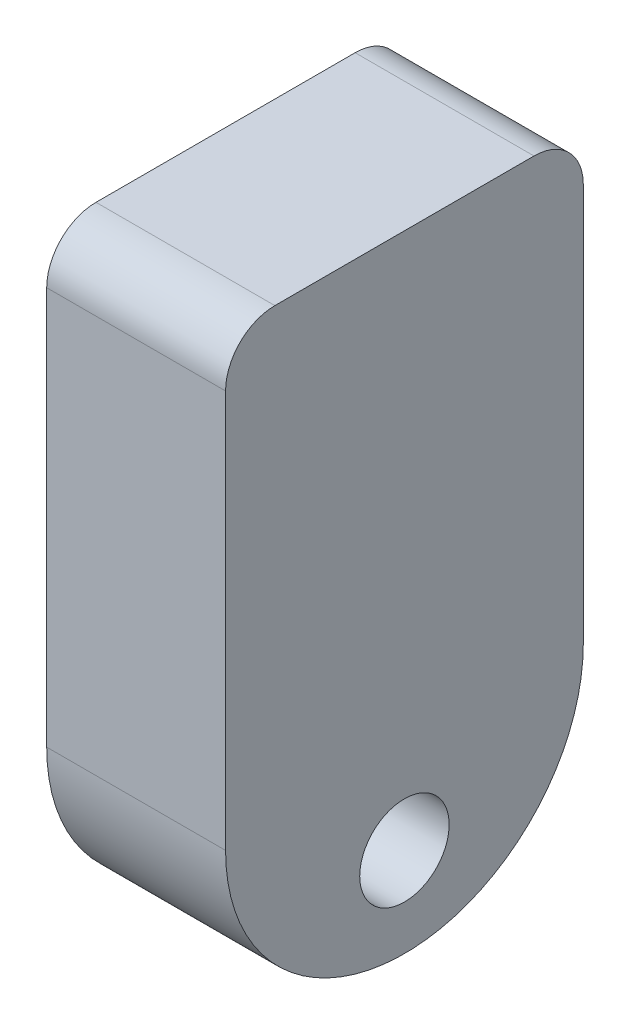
ISO-10303-21;
HEADER;
FILE_DESCRIPTION(('STEP AP214'),'2;1');
FILE_NAME('part.step','',(''),(''),'','','');
FILE_SCHEMA(('AUTOMOTIVE_DESIGN { 1 0 10303 214 1 1 1 1 }'));
ENDSEC;
DATA;
#1=APPLICATION_CONTEXT('core data for automotive mechanical design processes');
#2=APPLICATION_PROTOCOL_DEFINITION('international standard','automotive_design',2000,#1);
#3=PRODUCT_CONTEXT('',#1,'mechanical');
#4=PRODUCT('Part','Part','',(#3));
#5=PRODUCT_RELATED_PRODUCT_CATEGORY('part','',(#4));
#6=PRODUCT_DEFINITION_FORMATION('','',#4);
#7=PRODUCT_DEFINITION_CONTEXT('part definition',#1,'design');
#8=PRODUCT_DEFINITION('design','',#6,#7);
#9=PRODUCT_DEFINITION_SHAPE('','',#8);
#10=(LENGTH_UNIT() NAMED_UNIT(*) SI_UNIT(.MILLI.,.METRE.));
#11=(NAMED_UNIT(*) PLANE_ANGLE_UNIT() SI_UNIT($,.RADIAN.));
#12=(NAMED_UNIT(*) SI_UNIT($,.STERADIAN.) SOLID_ANGLE_UNIT());
#13=UNCERTAINTY_MEASURE_WITH_UNIT(LENGTH_MEASURE(1.E-05),#10,'distance_accuracy_value','');
#14=(GEOMETRIC_REPRESENTATION_CONTEXT(3) GLOBAL_UNCERTAINTY_ASSIGNED_CONTEXT((#13)) GLOBAL_UNIT_ASSIGNED_CONTEXT((#10,
#11,#12)) REPRESENTATION_CONTEXT('',''));
#15=CARTESIAN_POINT('',(0.,0.,0.));
#16=DIRECTION('',(0.,0.,1.));
#17=DIRECTION('',(1.,0.,0.));
#18=AXIS2_PLACEMENT_3D('',#15,#16,#17);
#19=CARTESIAN_POINT('',(25.4,0.,0.));
#20=DIRECTION('',(-1.,0.,0.));
#21=DIRECTION('',(0.,0.,1.));
#22=AXIS2_PLACEMENT_3D('',#19,#20,#21);
#23=PLANE('',#22);
#24=CARTESIAN_POINT('',(25.4,12.7,-25.4));
#25=DIRECTION('',(-1.,0.,0.));
#26=DIRECTION('',(0.,0.,1.));
#27=AXIS2_PLACEMENT_3D('',#24,#25,#26);
#28=CIRCLE('',#27,6.35);
#29=CARTESIAN_POINT('',(25.4,12.7,-19.05));
#30=VERTEX_POINT('',#29);
#31=EDGE_CURVE('E117',#30,#30,#28,.F.);
#32=ORIENTED_EDGE('',*,*,#31,.F.);
#33=EDGE_LOOP('',(#32));
#34=FACE_BOUND('',#33,.T.);
#35=DIRECTION('',(0.,1.,0.));
#36=VECTOR('',#35,1.);
#37=CARTESIAN_POINT('',(25.4,0.,-50.8));
#38=LINE('',#37,#36);
#39=CARTESIAN_POINT('',(25.4,25.4,-50.8));
#40=VERTEX_POINT('',#39);
#41=CARTESIAN_POINT('',(25.4,81.9,-50.8));
#42=VERTEX_POINT('',#41);
#43=EDGE_CURVE('E132',#40,#42,#38,.T.);
#44=ORIENTED_EDGE('',*,*,#43,.T.);
#45=CARTESIAN_POINT('',(25.4,81.9,-43.8));
#46=DIRECTION('',(-1.,0.,0.));
#47=DIRECTION('',(0.,0.,1.));
#48=AXIS2_PLACEMENT_3D('',#45,#46,#47);
#49=CIRCLE('',#48,7.);
#50=CARTESIAN_POINT('',(25.4,88.9,-43.8));
#51=VERTEX_POINT('',#50);
#52=EDGE_CURVE('E47',#42,#51,#49,.F.);
#53=ORIENTED_EDGE('',*,*,#52,.T.);
#54=DIRECTION('',(0.,0.,1.));
#55=VECTOR('',#54,1.);
#56=CARTESIAN_POINT('',(25.4,88.9,0.));
#57=LINE('',#56,#55);
#58=CARTESIAN_POINT('',(25.4,88.9,-6.99999999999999));
#59=VERTEX_POINT('',#58);
#60=EDGE_CURVE('E135',#51,#59,#57,.T.);
#61=ORIENTED_EDGE('',*,*,#60,.T.);
#62=CARTESIAN_POINT('',(25.4,81.9,-6.99999999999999));
#63=DIRECTION('',(-1.,0.,0.));
#64=DIRECTION('',(0.,0.,1.));
#65=AXIS2_PLACEMENT_3D('',#62,#63,#64);
#66=CIRCLE('',#65,7.);
#67=CARTESIAN_POINT('',(25.4,81.9,0.));
#68=VERTEX_POINT('',#67);
#69=EDGE_CURVE('E54',#59,#68,#66,.F.);
#70=ORIENTED_EDGE('',*,*,#69,.T.);
#71=DIRECTION('',(0.,-1.,0.));
#72=VECTOR('',#71,1.);
#73=CARTESIAN_POINT('',(25.4,0.,0.));
#74=LINE('',#73,#72);
#75=CARTESIAN_POINT('',(25.4,25.4,0.));
#76=VERTEX_POINT('',#75);
#77=EDGE_CURVE('E130',#68,#76,#74,.T.);
#78=ORIENTED_EDGE('',*,*,#77,.T.);
#79=CARTESIAN_POINT('',(25.4,25.4,-25.4));
#80=DIRECTION('',(1.,0.,0.));
#81=DIRECTION('',(0.,0.,-1.));
#82=AXIS2_PLACEMENT_3D('',#79,#80,#81);
#83=CIRCLE('',#82,25.4);
#84=EDGE_CURVE('E116',#76,#40,#83,.T.);
#85=ORIENTED_EDGE('',*,*,#84,.T.);
#86=EDGE_LOOP('',(#44,#53,#61,#70,#78,#85));
#87=FACE_BOUND('',#86,.T.);
#88=ADVANCED_FACE('F39',(#34,#87),#23,.F.);
#89=CARTESIAN_POINT('',(0.,0.,0.));
#90=DIRECTION('',(-1.,0.,0.));
#91=DIRECTION('',(0.,0.,1.));
#92=AXIS2_PLACEMENT_3D('',#89,#90,#91);
#93=PLANE('',#92);
#94=CARTESIAN_POINT('',(0.,63.5,-25.4));
#95=DIRECTION('',(1.,0.,0.));
#96=DIRECTION('',(0.,0.,-1.));
#97=AXIS2_PLACEMENT_3D('',#94,#95,#96);
#98=CIRCLE('',#97,6.35000000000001);
#99=CARTESIAN_POINT('',(0.,63.5,-31.75));
#100=VERTEX_POINT('',#99);
#101=EDGE_CURVE('E103',#100,#100,#98,.T.);
#102=ORIENTED_EDGE('',*,*,#101,.T.);
#103=EDGE_LOOP('',(#102));
#104=FACE_BOUND('',#103,.T.);
#105=DIRECTION('',(0.,0.,1.));
#106=VECTOR('',#105,1.);
#107=CARTESIAN_POINT('',(0.,88.9,0.));
#108=LINE('',#107,#106);
#109=CARTESIAN_POINT('',(0.,88.9,-43.8));
#110=VERTEX_POINT('',#109);
#111=CARTESIAN_POINT('',(0.,88.9,-6.99999999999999));
#112=VERTEX_POINT('',#111);
#113=EDGE_CURVE('E133',#110,#112,#108,.T.);
#114=ORIENTED_EDGE('',*,*,#113,.F.);
#115=CARTESIAN_POINT('',(0.,81.9,-43.8));
#116=DIRECTION('',(-1.,0.,0.));
#117=DIRECTION('',(0.,0.,1.));
#118=AXIS2_PLACEMENT_3D('',#115,#116,#117);
#119=CIRCLE('',#118,7.);
#120=CARTESIAN_POINT('',(0.,81.9,-50.8));
#121=VERTEX_POINT('',#120);
#122=EDGE_CURVE('E148',#110,#121,#119,.T.);
#123=ORIENTED_EDGE('',*,*,#122,.T.);
#124=DIRECTION('',(0.,1.,0.));
#125=VECTOR('',#124,1.);
#126=CARTESIAN_POINT('',(0.,0.,-50.8));
#127=LINE('',#126,#125);
#128=CARTESIAN_POINT('',(0.,25.4,-50.8));
#129=VERTEX_POINT('',#128);
#130=EDGE_CURVE('E102',#129,#121,#127,.T.);
#131=ORIENTED_EDGE('',*,*,#130,.F.);
#132=CARTESIAN_POINT('',(0.,25.4,-25.4));
#133=DIRECTION('',(1.,0.,0.));
#134=DIRECTION('',(0.,0.,-1.));
#135=AXIS2_PLACEMENT_3D('',#132,#133,#134);
#136=CIRCLE('',#135,25.4);
#137=CARTESIAN_POINT('',(0.,25.4,0.));
#138=VERTEX_POINT('',#137);
#139=EDGE_CURVE('E106',#138,#129,#136,.T.);
#140=ORIENTED_EDGE('',*,*,#139,.F.);
#141=DIRECTION('',(0.,-1.,0.));
#142=VECTOR('',#141,1.);
#143=CARTESIAN_POINT('',(0.,0.,0.));
#144=LINE('',#143,#142);
#145=CARTESIAN_POINT('',(0.,81.9,0.));
#146=VERTEX_POINT('',#145);
#147=EDGE_CURVE('E95',#146,#138,#144,.T.);
#148=ORIENTED_EDGE('',*,*,#147,.F.);
#149=CARTESIAN_POINT('',(0.,81.9,-6.99999999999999));
#150=DIRECTION('',(-1.,0.,0.));
#151=DIRECTION('',(0.,0.,1.));
#152=AXIS2_PLACEMENT_3D('',#149,#150,#151);
#153=CIRCLE('',#152,7.);
#154=EDGE_CURVE('E146',#146,#112,#153,.T.);
#155=ORIENTED_EDGE('',*,*,#154,.T.);
#156=EDGE_LOOP('',(#114,#123,#131,#140,#148,#155));
#157=FACE_BOUND('',#156,.T.);
#158=ADVANCED_FACE('F108',(#104,#157),#93,.T.);
#159=CARTESIAN_POINT('',(25.4,0.,-50.8));
#160=DIRECTION('',(0.,0.,1.));
#161=DIRECTION('',(0.,-1.,0.));
#162=AXIS2_PLACEMENT_3D('',#159,#160,#161);
#163=PLANE('',#162);
#164=ORIENTED_EDGE('',*,*,#130,.T.);
#165=DIRECTION('',(-1.,0.,0.));
#166=VECTOR('',#165,1.);
#167=CARTESIAN_POINT('',(25.4,81.9,-50.8));
#168=LINE('',#167,#166);
#169=EDGE_CURVE('E62',#121,#42,#168,.F.);
#170=ORIENTED_EDGE('',*,*,#169,.T.);
#171=ORIENTED_EDGE('',*,*,#43,.F.);
#172=DIRECTION('',(1.,0.,0.));
#173=VECTOR('',#172,1.);
#174=CARTESIAN_POINT('',(0.,25.4,-50.8));
#175=LINE('',#174,#173);
#176=EDGE_CURVE('E111',#129,#40,#175,.T.);
#177=ORIENTED_EDGE('',*,*,#176,.F.);
#178=EDGE_LOOP('',(#164,#170,#171,#177));
#179=FACE_BOUND('',#178,.T.);
#180=ADVANCED_FACE('F159',(#179),#163,.F.);
#181=CARTESIAN_POINT('',(25.4,63.5,-25.4));
#182=DIRECTION('',(-1.,0.,0.));
#183=DIRECTION('',(0.,0.,1.));
#184=AXIS2_PLACEMENT_3D('',#181,#182,#183);
#185=CYLINDRICAL_SURFACE('',#184,6.35000000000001);
#186=ORIENTED_EDGE('',*,*,#101,.F.);
#187=EDGE_LOOP('',(#186));
#188=FACE_BOUND('',#187,.T.);
#189=CARTESIAN_POINT('',(24.4,63.5,-25.4));
#190=DIRECTION('',(1.,0.,0.));
#191=DIRECTION('',(0.,0.,-1.));
#192=AXIS2_PLACEMENT_3D('',#189,#190,#191);
#193=CIRCLE('',#192,6.35000000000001);
#194=CARTESIAN_POINT('',(24.4,63.5,-31.75));
#195=VERTEX_POINT('',#194);
#196=EDGE_CURVE('E125',#195,#195,#193,.T.);
#197=ORIENTED_EDGE('',*,*,#196,.T.);
#198=EDGE_LOOP('',(#197));
#199=FACE_BOUND('',#198,.T.);
#200=ADVANCED_FACE('F176',(#188,#199),#185,.F.);
#201=CARTESIAN_POINT('',(25.4,0.,0.));
#202=DIRECTION('',(0.,0.,-1.));
#203=DIRECTION('',(0.,1.,0.));
#204=AXIS2_PLACEMENT_3D('',#201,#202,#203);
#205=PLANE('',#204);
#206=ORIENTED_EDGE('',*,*,#77,.F.);
#207=DIRECTION('',(-1.,0.,0.));
#208=VECTOR('',#207,1.);
#209=CARTESIAN_POINT('',(25.4,81.9,0.));
#210=LINE('',#209,#208);
#211=EDGE_CURVE('E11',#68,#146,#210,.T.);
#212=ORIENTED_EDGE('',*,*,#211,.T.);
#213=ORIENTED_EDGE('',*,*,#147,.T.);
#214=DIRECTION('',(1.,0.,0.));
#215=VECTOR('',#214,1.);
#216=CARTESIAN_POINT('',(0.,25.4,0.));
#217=LINE('',#216,#215);
#218=EDGE_CURVE('E99',#138,#76,#217,.T.);
#219=ORIENTED_EDGE('',*,*,#218,.T.);
#220=EDGE_LOOP('',(#206,#212,#213,#219));
#221=FACE_BOUND('',#220,.T.);
#222=ADVANCED_FACE('F97',(#221),#205,.F.);
#223=CARTESIAN_POINT('',(25.4,88.9,0.));
#224=DIRECTION('',(0.,-1.,0.));
#225=DIRECTION('',(0.,0.,-1.));
#226=AXIS2_PLACEMENT_3D('',#223,#224,#225);
#227=PLANE('',#226);
#228=ORIENTED_EDGE('',*,*,#60,.F.);
#229=DIRECTION('',(-1.,0.,0.));
#230=VECTOR('',#229,1.);
#231=CARTESIAN_POINT('',(25.4,88.9,-43.8));
#232=LINE('',#231,#230);
#233=EDGE_CURVE('E143',#51,#110,#232,.T.);
#234=ORIENTED_EDGE('',*,*,#233,.T.);
#235=ORIENTED_EDGE('',*,*,#113,.T.);
#236=DIRECTION('',(-1.,0.,0.));
#237=VECTOR('',#236,1.);
#238=CARTESIAN_POINT('',(25.4,88.9,-6.99999999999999));
#239=LINE('',#238,#237);
#240=EDGE_CURVE('E136',#112,#59,#239,.F.);
#241=ORIENTED_EDGE('',*,*,#240,.T.);
#242=EDGE_LOOP('',(#228,#234,#235,#241));
#243=FACE_BOUND('',#242,.T.);
#244=ADVANCED_FACE('F156',(#243),#227,.F.);
#245=CARTESIAN_POINT('',(24.4,63.5,-25.4));
#246=DIRECTION('',(1.,0.,0.));
#247=DIRECTION('',(0.,0.,-1.));
#248=AXIS2_PLACEMENT_3D('',#245,#246,#247);
#249=PLANE('',#248);
#250=ORIENTED_EDGE('',*,*,#196,.F.);
#251=EDGE_LOOP('',(#250));
#252=FACE_BOUND('',#251,.T.);
#253=ADVANCED_FACE('F181',(#252),#249,.F.);
#254=CARTESIAN_POINT('',(0.,25.4,-25.4));
#255=DIRECTION('',(1.,0.,0.));
#256=DIRECTION('',(0.,0.,-1.));
#257=AXIS2_PLACEMENT_3D('',#254,#255,#256);
#258=CYLINDRICAL_SURFACE('',#257,25.4);
#259=ORIENTED_EDGE('',*,*,#84,.F.);
#260=ORIENTED_EDGE('',*,*,#218,.F.);
#261=ORIENTED_EDGE('',*,*,#139,.T.);
#262=ORIENTED_EDGE('',*,*,#176,.T.);
#263=EDGE_LOOP('',(#259,#260,#261,#262));
#264=FACE_BOUND('',#263,.T.);
#265=ADVANCED_FACE('F114',(#264),#258,.T.);
#266=CARTESIAN_POINT('',(25.400012,12.7,-25.4));
#267=DIRECTION('',(-1.,0.,0.));
#268=DIRECTION('',(0.,0.,1.));
#269=AXIS2_PLACEMENT_3D('',#266,#267,#268);
#270=CYLINDRICAL_SURFACE('',#269,6.35);
#271=CARTESIAN_POINT('',(1.,12.7,-25.4));
#272=DIRECTION('',(1.,0.,0.));
#273=DIRECTION('',(0.,0.,-1.));
#274=AXIS2_PLACEMENT_3D('',#271,#272,#273);
#275=CIRCLE('',#274,6.35);
#276=CARTESIAN_POINT('',(0.999999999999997,12.7,-19.05));
#277=VERTEX_POINT('',#276);
#278=EDGE_CURVE('E120',#277,#277,#275,.T.);
#279=CARTESIAN_POINT('',(0.999999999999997,12.7,-19.05));
#280=CARTESIAN_POINT('',(1.25416666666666,12.7,-19.05));
#281=CARTESIAN_POINT('',(1.50833333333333,12.7,-19.05));
#282=CARTESIAN_POINT('',(2.01666666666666,12.7,-19.05));
#283=CARTESIAN_POINT('',(2.27083333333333,12.7,-19.05));
#284=CARTESIAN_POINT('',(2.77916666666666,12.7,-19.05));
#285=CARTESIAN_POINT('',(3.03333333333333,12.7,-19.05));
#286=CARTESIAN_POINT('',(3.54166666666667,12.7,-19.05));
#287=CARTESIAN_POINT('',(3.79583333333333,12.7,-19.05));
#288=CARTESIAN_POINT('',(4.30416666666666,12.7,-19.05));
#289=CARTESIAN_POINT('',(4.55833333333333,12.7,-19.05));
#290=CARTESIAN_POINT('',(5.06666666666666,12.7,-19.05));
#291=CARTESIAN_POINT('',(5.32083333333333,12.7,-19.05));
#292=CARTESIAN_POINT('',(5.82916666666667,12.7,-19.05));
#293=CARTESIAN_POINT('',(6.08333333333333,12.7,-19.05));
#294=CARTESIAN_POINT('',(6.59166666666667,12.7,-19.05));
#295=CARTESIAN_POINT('',(6.84583333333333,12.7,-19.05));
#296=CARTESIAN_POINT('',(7.35416666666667,12.7,-19.05));
#297=CARTESIAN_POINT('',(7.60833333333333,12.7,-19.05));
#298=CARTESIAN_POINT('',(8.11666666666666,12.7,-19.05));
#299=CARTESIAN_POINT('',(8.37083333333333,12.7,-19.05));
#300=CARTESIAN_POINT('',(8.87916666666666,12.7,-19.05));
#301=CARTESIAN_POINT('',(9.13333333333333,12.7,-19.05));
#302=CARTESIAN_POINT('',(9.64166666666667,12.7,-19.05));
#303=CARTESIAN_POINT('',(9.89583333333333,12.7,-19.05));
#304=CARTESIAN_POINT('',(10.4041666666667,12.7,-19.05));
#305=CARTESIAN_POINT('',(10.6583333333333,12.7,-19.05));
#306=CARTESIAN_POINT('',(11.1666666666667,12.7,-19.05));
#307=CARTESIAN_POINT('',(11.4208333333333,12.7,-19.05));
#308=CARTESIAN_POINT('',(11.9291666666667,12.7,-19.05));
#309=CARTESIAN_POINT('',(12.1833333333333,12.7,-19.05));
#310=CARTESIAN_POINT('',(12.6916666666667,12.7,-19.05));
#311=CARTESIAN_POINT('',(12.9458333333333,12.7,-19.05));
#312=CARTESIAN_POINT('',(13.4541666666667,12.7,-19.05));
#313=CARTESIAN_POINT('',(13.7083333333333,12.7,-19.05));
#314=CARTESIAN_POINT('',(14.2166666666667,12.7,-19.05));
#315=CARTESIAN_POINT('',(14.4708333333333,12.7,-19.05));
#316=CARTESIAN_POINT('',(14.9791666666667,12.7,-19.05));
#317=CARTESIAN_POINT('',(15.2333333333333,12.7,-19.05));
#318=CARTESIAN_POINT('',(15.7416666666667,12.7,-19.05));
#319=CARTESIAN_POINT('',(15.9958333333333,12.7,-19.05));
#320=CARTESIAN_POINT('',(16.5041666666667,12.7,-19.05));
#321=CARTESIAN_POINT('',(16.7583333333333,12.7,-19.05));
#322=CARTESIAN_POINT('',(17.2666666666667,12.7,-19.05));
#323=CARTESIAN_POINT('',(17.5208333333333,12.7,-19.05));
#324=CARTESIAN_POINT('',(18.0291666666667,12.7,-19.05));
#325=CARTESIAN_POINT('',(18.2833333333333,12.7,-19.05));
#326=CARTESIAN_POINT('',(18.7916666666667,12.7,-19.05));
#327=CARTESIAN_POINT('',(19.0458333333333,12.7,-19.05));
#328=CARTESIAN_POINT('',(19.5541666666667,12.7,-19.05));
#329=CARTESIAN_POINT('',(19.8083333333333,12.7,-19.05));
#330=CARTESIAN_POINT('',(20.3166666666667,12.7,-19.05));
#331=CARTESIAN_POINT('',(20.5708333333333,12.7,-19.05));
#332=CARTESIAN_POINT('',(21.0791666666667,12.7,-19.05));
#333=CARTESIAN_POINT('',(21.3333333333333,12.7,-19.05));
#334=CARTESIAN_POINT('',(21.8416666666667,12.7,-19.05));
#335=CARTESIAN_POINT('',(22.0958333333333,12.7,-19.05));
#336=CARTESIAN_POINT('',(22.6041666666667,12.7,-19.05));
#337=CARTESIAN_POINT('',(22.8583333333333,12.7,-19.05));
#338=CARTESIAN_POINT('',(23.3666666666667,12.7,-19.05));
#339=CARTESIAN_POINT('',(23.6208333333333,12.7,-19.05));
#340=CARTESIAN_POINT('',(24.1291666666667,12.7,-19.05));
#341=CARTESIAN_POINT('',(24.3833333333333,12.7,-19.05));
#342=CARTESIAN_POINT('',(24.8916666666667,12.7,-19.05));
#343=CARTESIAN_POINT('',(25.1458333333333,12.7,-19.05));
#344=CARTESIAN_POINT('',(25.4,12.7,-19.05));
#345=B_SPLINE_CURVE_WITH_KNOTS('',3,(#279,#280,#281,#282,#283,#284,#285,#286,#287,#288,#289,
#290,#291,#292,#293,#294,#295,#296,#297,#298,#299,#300,#301,#302,#303,#304,#305,#306,#307,#308,
#309,#310,#311,#312,#313,#314,#315,#316,#317,#318,#319,#320,#321,#322,#323,#324,#325,#326,#327,
#328,#329,#330,#331,#332,#333,#334,#335,#336,#337,#338,#339,#340,#341,#342,#343,#344),
.UNSPECIFIED.,.F.,.F.,(4,2,2,2,2,2,2,2,2,2,2,2,2,2,2,2,2,2,2,2,2,2,2,2,2,2,2,2,2,2,2,2,4),(0.,
0.762499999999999,1.525,2.2875,3.05,3.8125,4.575,5.3375,6.1,6.8625,7.625,8.3875,9.15,9.9125,
10.675,11.4375,12.2,12.9625,13.725,14.4875,15.25,16.0125,16.775,17.5375,18.3,19.0625,19.825,
20.5875,21.35,22.1125,22.875,23.6375,24.4),.UNSPECIFIED.);
#346=EDGE_CURVE('BSEAM199',#277,#30,#345,.T.);
#347=ORIENTED_EDGE('',*,*,#278,.F.);
#348=ORIENTED_EDGE('',*,*,#31,.T.);
#349=ORIENTED_EDGE('',*,*,#346,.T.);
#350=ORIENTED_EDGE('',*,*,#346,.F.);
#351=EDGE_LOOP('',(#347,#349,#348,#350));
#352=FACE_BOUND('',#351,.T.);
#353=ADVANCED_FACE('F199',(#352),#270,.F.);
#354=CARTESIAN_POINT('',(1.,0.,0.));
#355=DIRECTION('',(1.,0.,0.));
#356=DIRECTION('',(0.,0.,-1.));
#357=AXIS2_PLACEMENT_3D('',#354,#355,#356);
#358=PLANE('',#357);
#359=ORIENTED_EDGE('',*,*,#278,.T.);
#360=EDGE_LOOP('',(#359));
#361=FACE_BOUND('',#360,.T.);
#362=ADVANCED_FACE('F165',(#361),#358,.T.);
#363=CARTESIAN_POINT('',(25.4,81.9,-43.8));
#364=DIRECTION('',(-1.,0.,0.));
#365=DIRECTION('',(0.,0.,1.));
#366=AXIS2_PLACEMENT_3D('',#363,#364,#365);
#367=CYLINDRICAL_SURFACE('',#366,7.);
#368=ORIENTED_EDGE('',*,*,#52,.F.);
#369=ORIENTED_EDGE('',*,*,#169,.F.);
#370=ORIENTED_EDGE('',*,*,#122,.F.);
#371=ORIENTED_EDGE('',*,*,#233,.F.);
#372=EDGE_LOOP('',(#368,#369,#370,#371));
#373=FACE_BOUND('',#372,.T.);
#374=ADVANCED_FACE('F158',(#373),#367,.T.);
#375=CARTESIAN_POINT('',(25.4,81.9,-6.99999999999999));
#376=DIRECTION('',(-1.,0.,0.));
#377=DIRECTION('',(0.,0.,1.));
#378=AXIS2_PLACEMENT_3D('',#375,#376,#377);
#379=CYLINDRICAL_SURFACE('',#378,7.);
#380=ORIENTED_EDGE('',*,*,#69,.F.);
#381=ORIENTED_EDGE('',*,*,#240,.F.);
#382=ORIENTED_EDGE('',*,*,#154,.F.);
#383=ORIENTED_EDGE('',*,*,#211,.F.);
#384=EDGE_LOOP('',(#380,#381,#382,#383));
#385=FACE_BOUND('',#384,.T.);
#386=ADVANCED_FACE('F41',(#385),#379,.T.);
#387=CLOSED_SHELL('',(#88,#158,#180,#200,#222,#244,#253,#265,#353,#362,#374,#386));
#388=MANIFOLD_SOLID_BREP('B2',#387);
#389=ADVANCED_BREP_SHAPE_REPRESENTATION('',(#18,#388),#14);
#390=SHAPE_DEFINITION_REPRESENTATION(#9,#389);
ENDSEC;
END-ISO-10303-21;
